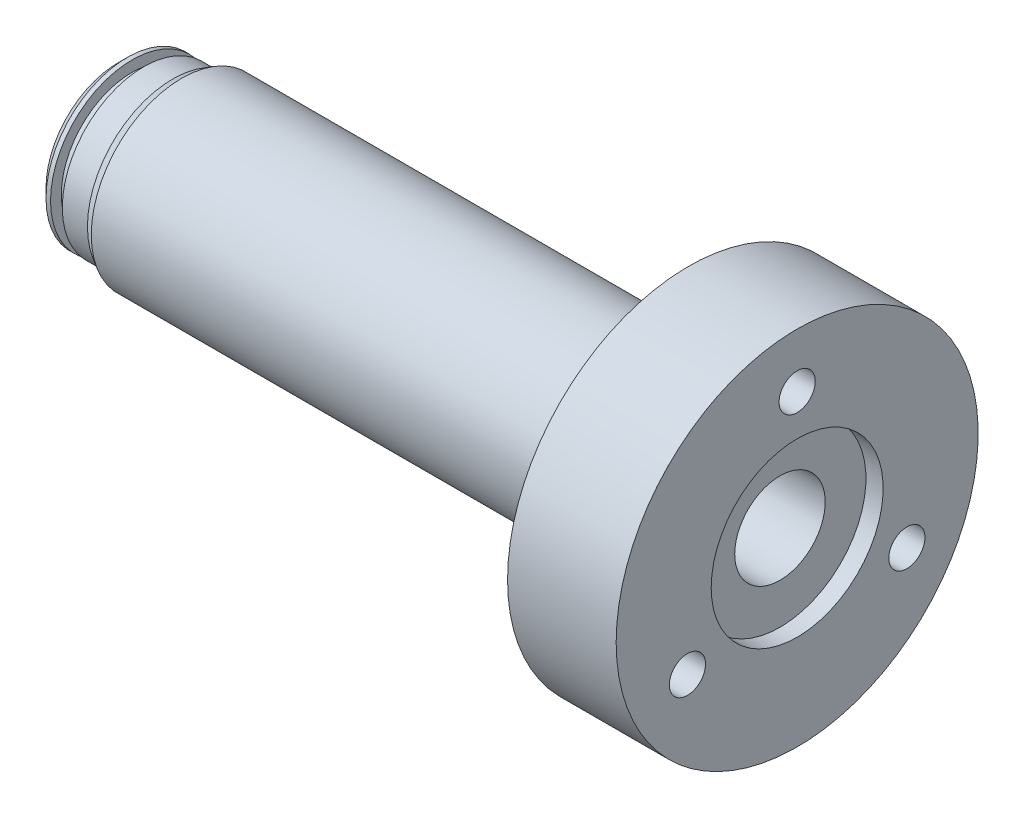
from build123d import *

# Parameters (mm, degrees)
R_P_TITION_CIRCULAIRE1_COUNT = 3


with BuildPart() as part:
    # Esquisse1 → R_volution1 (revolve)
    with BuildSketch(Plane.XY, mode=Mode.PRIVATE) as r_volution1_sk:
        with BuildLine():
            Line((0, 5), (0, 8))
            Line((0, 8), (1, 9))
            Line((1, 9), (1.5, 9))
            Line((1.5, 9), (1.5, 7.807852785))
            Line((1.5, 7.807852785), (2.8, 7.807852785))
            Line((2.8, 7.807852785), (2.8, 9))
            Line((2.8, 9), (6, 9))
            Line((6, 9), (6, 9.422649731))
            Line((6, 9.422649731), (7, 10))
            Line((7, 10), (56, 10))
            ThreePointArc((56, 10), (57, 9), (58, 10))
            Line((58, 10), (58, 12.5))
            Line((58, 12.5), (63, 12.5))
            Line((63, 12.5), (63, 20))
            Line((63, 20), (75, 20))
            Line((75, 20), (75, 9.5))
            Line((75, 9.5), (73.1, 9.5))
            Line((73.1, 9.5), (73.1, 5))
            Line((73.1, 5), (0, 5))
        make_face()
    revolve(r_volution1_sk.sketch.rotate(Axis((0, 0, 0), (1, 0, 0)), 90), axis=Axis((0, 0, 0), (1, 0, 0)))

    # Esquisse2 → Trou taraud_ M5x0.81 (revolve, cut)
    with BuildSketch(Plane(origin=(75, 14, 0), x_dir=(0, 0, -1), z_dir=(0, 1, 0))):
        Polygon((0, 0), (0, 10.201721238), (2, 9), (2, 0), align=None)
    trou_taraud_m5x0_81 = revolve(axis=Axis((81.35, 14, 0), (-1, 0, 0)), mode=Mode.SUBTRACT)

    # R_p_tition circulaire1: Trou taraud_ M5x0.81 ×3 about axis
    r_p_tition_circulaire1_axis = Axis((0, 0, 0), (1, 0, 0))
    for i in range(1, R_P_TITION_CIRCULAIRE1_COUNT):
        add(trou_taraud_m5x0_81.rotate(r_p_tition_circulaire1_axis, i * 360 / R_P_TITION_CIRCULAIRE1_COUNT), mode=Mode.SUBTRACT)


solid = part.part
